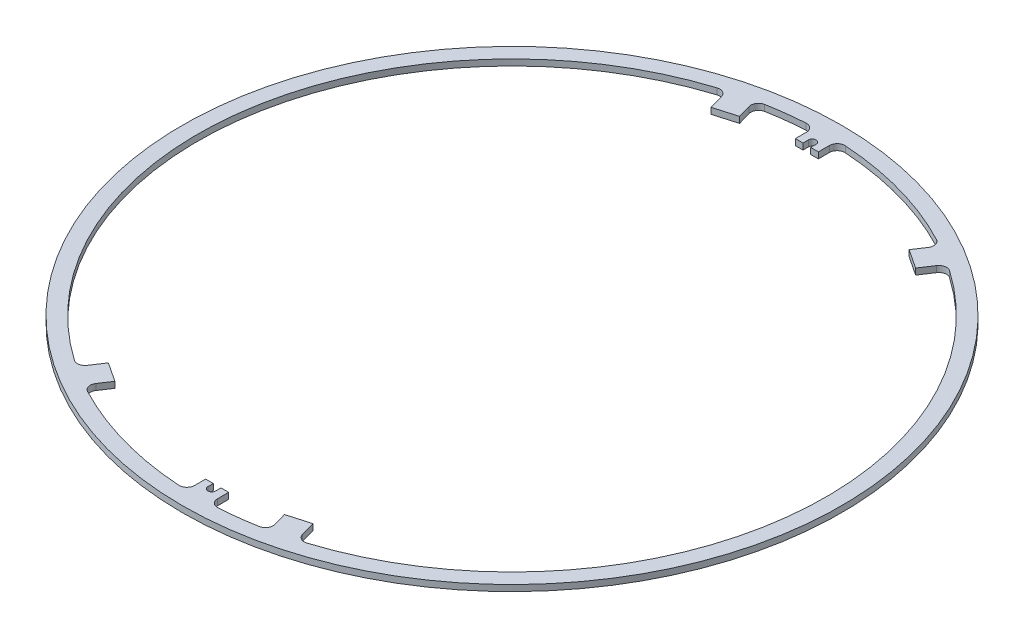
from build123d import *

# Parameters (mm, degrees)
SKETCH_1_R          = 43
SKETCH_1_R_2        = 41
EXTRUDE_1_DEPTH     = 0.8
EXTRUDE_START       = -0.8
EXTRUDE_2_DEPTH     = 0.8
FILLET_1_R          = 1
FILLET_2_R          = 1
CUT_EXTRUDE_1_DEPTH = 61.816445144
EXTRUDE_3_DEPTH     = 0.8
FILLET_3_R          = 1
EXTRUDE_4_DEPTH     = 0.8
FILLET_4_R          = 1


with BuildPart() as part:
    # Sketch 1 → Extrude 1 (new body)
    with BuildSketch(Plane(origin=(0, 0, 0), x_dir=(1, 0, 0), z_dir=(0, 1, 0))):
        with Locations(Location((0, 0, 0), (0, 0, 270))):
            Circle(SKETCH_1_R)
        with Locations(Location((0, 0, 0), (0, 0, 270))):
            Circle(SKETCH_1_R_2, mode=Mode.SUBTRACT)
    extrude(amount=EXTRUDE_1_DEPTH)

    # Sketch 2 → Extrude 2 (add)
    with BuildSketch(Plane(origin=(0, 0.8, 0), x_dir=(1, 0, 0), z_dir=(0, 1, 0)).offset(EXTRUDE_START)):
        with BuildLine():
            Line((-1.5, -38.472551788), (-1.5, -40.972551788))
            ThreePointArc((-1.5, -40.972551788), (0, -41), (1.5, -40.972551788))
            Line((1.5, -40.972551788), (1.5, -38.472551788))
            Line((1.5, -38.472551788), (-1.5, -38.472551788))
        make_face()
        with BuildLine():
            ThreePointArc((1.5, 40.972551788), (0, 41), (-1.5, 40.972551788))
            Line((-1.5, 40.972551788), (-1.5, 38.472551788))
            Line((-1.5, 38.472551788), (1.5, 38.472551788))
            Line((1.5, 38.472551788), (1.5, 40.972551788))
        make_face()
    extrude(amount=EXTRUDE_2_DEPTH)

    # Fillet 1
    fillet_1_edges = [part.edges().sort_by_distance(p)[0] for p in [
        (-1.5, 0.4, -40.972551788),
        (1.5, 0.4, -40.972551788),
    ]]
    fillet(fillet_1_edges, radius=FILLET_1_R)

    # Fillet 2
    fillet_2_edges = [part.edges().sort_by_distance(p)[0] for p in [
        (-1.5, 0.4, 40.972551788),
        (1.5, 0.4, 40.972551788),
    ]]
    fillet(fillet_2_edges, radius=FILLET_2_R)

    # Sketch 3 → Cut-Extrude 1 (cut, through all)
    with BuildSketch(Plane.XZ):
        with BuildLine():
            Line((-0.5, 39.172551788), (-0.5, 36.172551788))
            Line((-0.5, 36.172551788), (0.5, 36.172551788))
            Line((0.5, 36.172551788), (0.5, 39.172551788))
            ThreePointArc((0.5, 39.172551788), (0, 39.672551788), (-0.5, 39.172551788))
        make_face()
        with BuildLine():
            Line((0.5, -36.172551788), (0.5, -39.172551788))
            ThreePointArc((0.5, -39.172551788), (0, -39.672551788), (-0.5, -39.172551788))
            Line((-0.5, -39.172551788), (-0.5, -36.172551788))
            Line((-0.5, -36.172551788), (0.5, -36.172551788))
        make_face()
    extrude(amount=-CUT_EXTRUDE_1_DEPTH, mode=Mode.SUBTRACT)

    # Sketch 4 → Extrude 3 (add)
    with BuildSketch(Plane(origin=(0, 0.8, 0), x_dir=(1, 0, 0), z_dir=(0, 1, 0)).offset(EXTRUDE_START)):
        with BuildLine():
            Line((-22.629416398, -34.189318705), (-20.973605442, -31.687661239))
            Line((-20.973605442, -31.687661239), (-18.471947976, -33.343472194))
            Line((-18.471947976, -33.343472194), (-20.067099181, -35.753482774))
            ThreePointArc((-20.067099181, -35.753482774), (-21.362578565, -34.994860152), (-22.629416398, -34.189318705))
        make_face()
        with BuildLine():
            Line((22.629416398, 34.189318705), (20.973605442, 31.687661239))
            Line((20.973605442, 31.687661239), (18.471947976, 33.343472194))
            Line((18.471947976, 33.343472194), (20.067099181, 35.753482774))
            ThreePointArc((20.067099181, 35.753482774), (21.362578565, 34.994860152), (22.629416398, 34.189318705))
        make_face()
    extrude(amount=EXTRUDE_3_DEPTH)

    # Fillet 3
    fillet_3_edges = [part.edges().sort_by_distance(p)[0] for p in [
        (-20.067099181, 0.4, 35.753482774),
        (-22.629416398, 0.4, 34.189318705),
        (20.067099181, 0.4, -35.753482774),
        (22.629416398, 0.4, -34.189318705),
    ]]
    fillet(fillet_3_edges, radius=FILLET_3_R)

    # Sketch 5 → Extrude 4 (add)
    with BuildSketch(Plane.XZ):
        with BuildLine():
            Line((11.36033367, 39.394705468), (10.529089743, 36.512166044))
            Line((10.529089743, 36.512166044), (7.646550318, 37.343409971))
            Line((7.646550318, 37.343409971), (8.447342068, 40.120349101))
            ThreePointArc((8.447342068, 40.120349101), (9.910481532, 39.784197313), (11.36033367, 39.394705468))
        make_face()
        with BuildLine():
            Line((-7.646550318, -37.343409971), (-8.447342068, -40.120349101))
            ThreePointArc((-8.447342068, -40.120349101), (-9.910481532, -39.784197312), (-11.36033367, -39.394705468))
            Line((-11.36033367, -39.394705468), (-10.529089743, -36.512166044))
            Line((-10.529089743, -36.512166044), (-7.646550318, -37.343409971))
        make_face()
    extrude(amount=-EXTRUDE_4_DEPTH)

    # Fillet 4
    fillet_4_edges = [part.edges().sort_by_distance(p)[0] for p in [
        (11.36033367, 0.4, 39.394705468),
        (8.447342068, 0.4, 40.120349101),
        (-11.36033367, 0.4, -39.394705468),
        (-8.447342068, 0.4, -40.120349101),
    ]]
    fillet(fillet_4_edges, radius=FILLET_4_R)


solid = part.part
